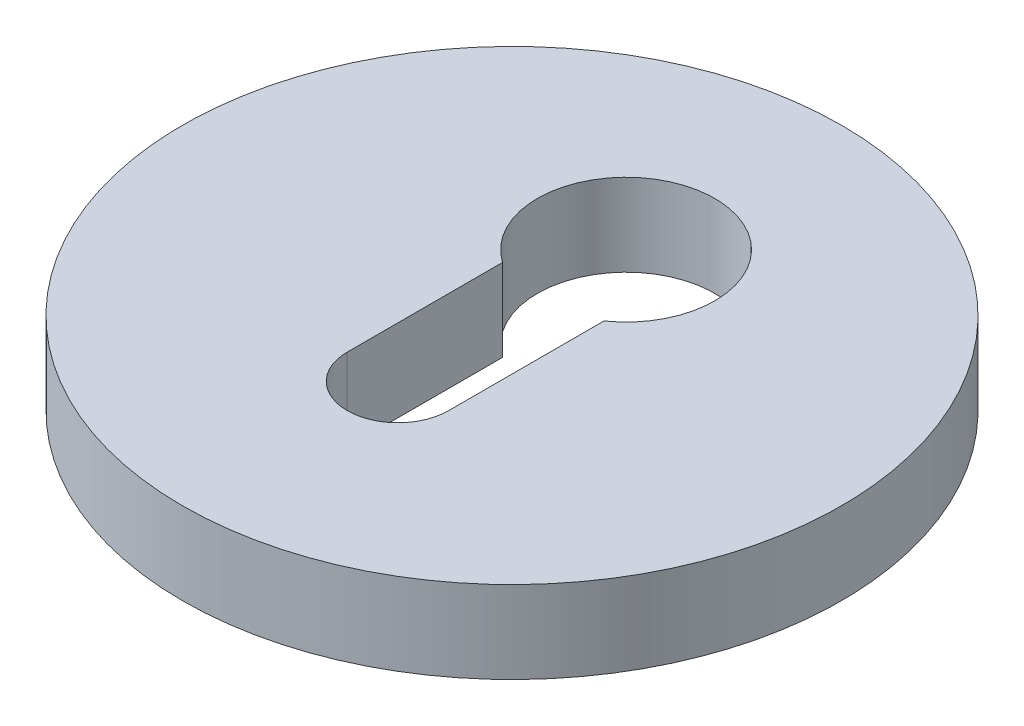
from build123d import *

# Parameters (mm, degrees)
SKETCH1_R           = 16.51
BOSS_EXTRUDE1_DEPTH = 4.120605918
SKETCH2_R           = 4.445
CUT_EXTRUDE1_DEPTH  = 25.4


with BuildPart() as part:
    # Sketch1 → Boss-Extrude1 (new body)
    with BuildSketch(Plane(origin=(0, 0, 0), x_dir=(1, 0, 0), z_dir=(0, 1, 0))):
        with Locations(Location((0, 0, 0), (0, 0, 270))):
            Circle(SKETCH1_R)
    extrude(amount=BOSS_EXTRUDE1_DEPTH)

    # Sketch2 → Cut-Extrude1 (cut)
    with BuildSketch(Plane(origin=(0, 4.120605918, 0), x_dir=(1, 0, 0), z_dir=(0, 1, 0))):
        with Locations((0, 5.715)):
            Circle(SKETCH2_R)
        with BuildLine():
            Line((2.54, 5.715), (2.54, -5.715))
            ThreePointArc((2.54, -5.715), (0, -8.255), (-2.54, -5.715))
            Line((-2.54, -5.715), (-2.54, 5.715))
            ThreePointArc((-2.54, 5.715), (0, 8.255), (2.54, 5.715))
        make_face()
    extrude(amount=-CUT_EXTRUDE1_DEPTH, mode=Mode.SUBTRACT)


solid = part.part
